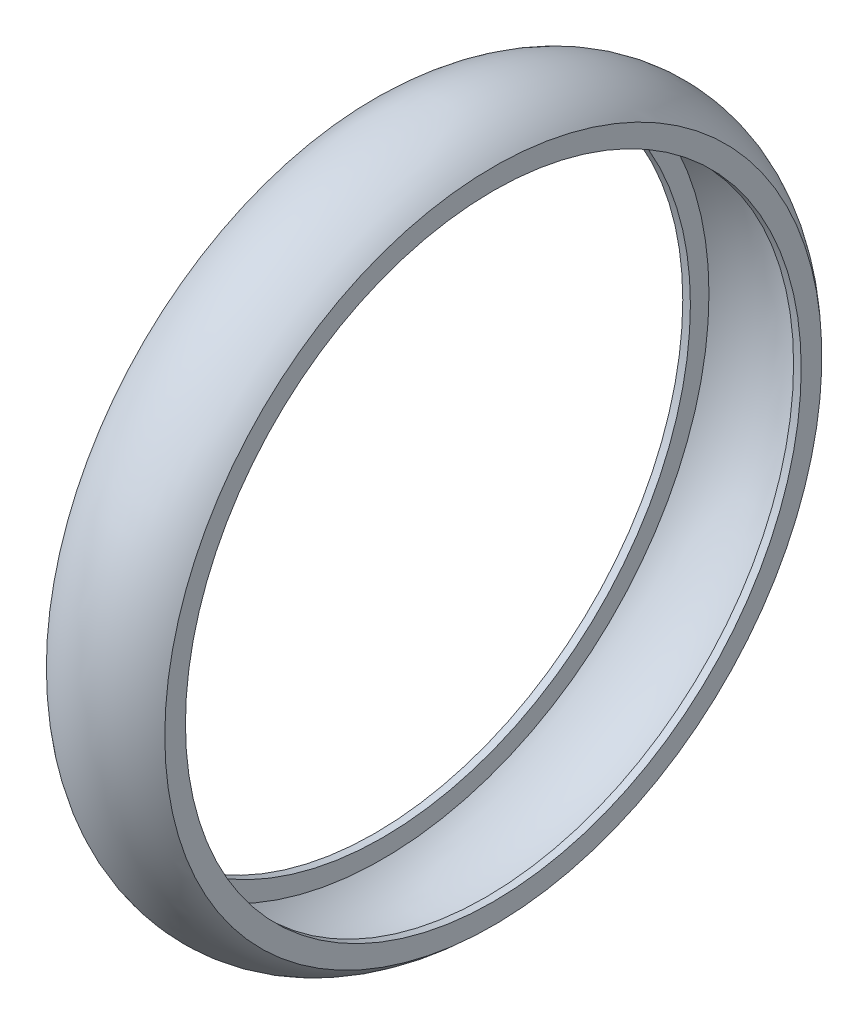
from build123d import *


with BuildPart() as part:
    # Esquisse1 → R_volution2 (revolve)
    with BuildSketch(Plane.XY, mode=Mode.PRIVATE) as r_volution2_sk:
        with BuildLine():
            Line((0, 0), (0, -2))
            Line((0, -2), (0.73829378, -2))
            Line((0.73829378, -2), (0.73829378, -0.2))
            ThreePointArc((0.73829378, -0.2), (5.73829378, 1.581518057), (10.73829378, -0.2))
            Line((10.73829378, -0.2), (10.73829378, -2))
            Line((10.73829378, -2), (11.47658756, -2))
            Line((11.47658756, -2), (11.47658756, 0))
            ThreePointArc((11.47658756, 0), (5.73829378, 2.376879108), (0, 0))
        make_face()
    revolve(r_volution2_sk.sketch.rotate(Axis((5, -31.834708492, 0), (1, 0, 0)), 90), axis=Axis((5, -31.834708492, 0), (1, 0, 0)))


solid = part.part
